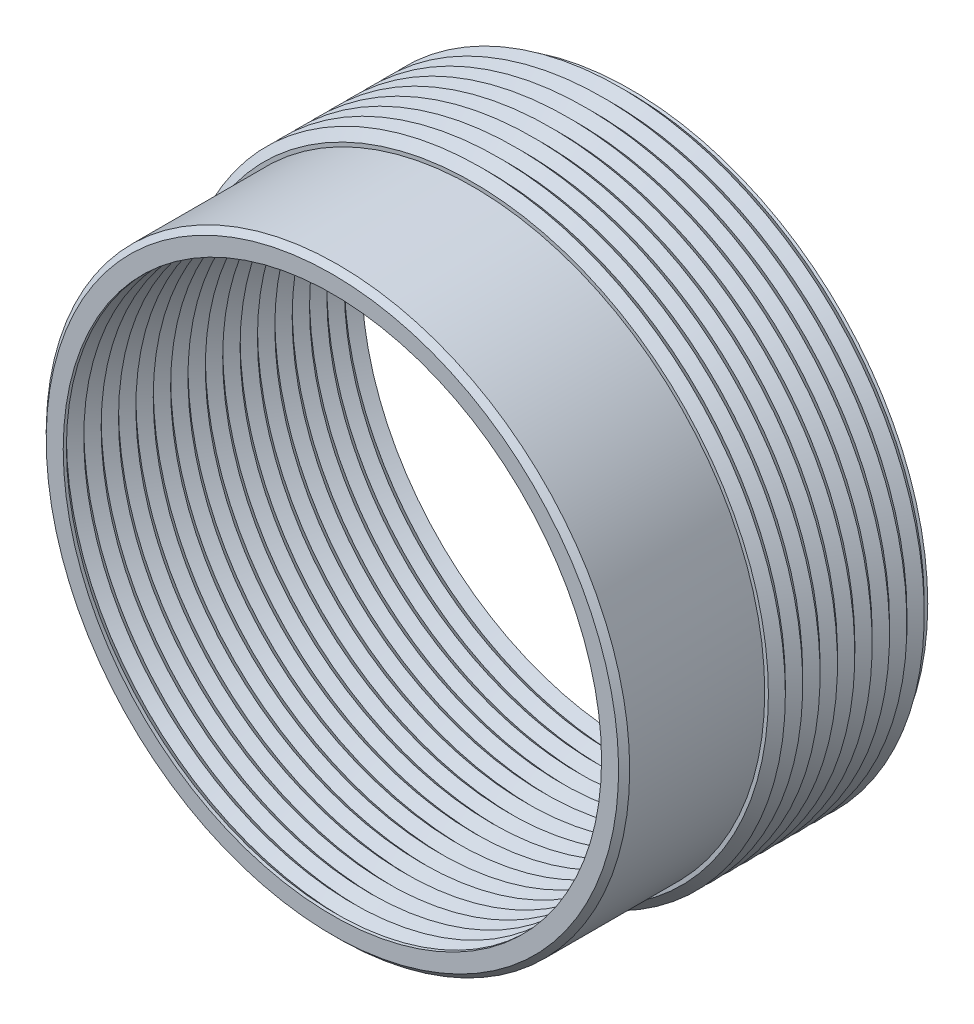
ISO-10303-21;
HEADER;
FILE_DESCRIPTION(('STEP AP214'),'2;1');
FILE_NAME('part.step','',(''),(''),'','','');
FILE_SCHEMA(('AUTOMOTIVE_DESIGN { 1 0 10303 214 1 1 1 1 }'));
ENDSEC;
DATA;
#1=APPLICATION_CONTEXT('core data for automotive mechanical design processes');
#2=APPLICATION_PROTOCOL_DEFINITION('international standard','automotive_design',2000,#1);
#3=PRODUCT_CONTEXT('',#1,'mechanical');
#4=PRODUCT('Part','Part','',(#3));
#5=PRODUCT_RELATED_PRODUCT_CATEGORY('part','',(#4));
#6=PRODUCT_DEFINITION_FORMATION('','',#4);
#7=PRODUCT_DEFINITION_CONTEXT('part definition',#1,'design');
#8=PRODUCT_DEFINITION('design','',#6,#7);
#9=PRODUCT_DEFINITION_SHAPE('','',#8);
#10=(LENGTH_UNIT() NAMED_UNIT(*) SI_UNIT(.MILLI.,.METRE.));
#11=(NAMED_UNIT(*) PLANE_ANGLE_UNIT() SI_UNIT($,.RADIAN.));
#12=(NAMED_UNIT(*) SI_UNIT($,.STERADIAN.) SOLID_ANGLE_UNIT());
#13=UNCERTAINTY_MEASURE_WITH_UNIT(LENGTH_MEASURE(1.E-05),#10,'distance_accuracy_value','');
#14=(GEOMETRIC_REPRESENTATION_CONTEXT(3) GLOBAL_UNCERTAINTY_ASSIGNED_CONTEXT((#13)) GLOBAL_UNIT_ASSIGNED_CONTEXT((#10,
#11,#12)) REPRESENTATION_CONTEXT('',''));
#15=CARTESIAN_POINT('',(0.,0.,0.));
#16=DIRECTION('',(0.,0.,1.));
#17=DIRECTION('',(1.,0.,0.));
#18=AXIS2_PLACEMENT_3D('',#15,#16,#17);
#19=CARTESIAN_POINT('',(0.,0.,2.778125));
#20=DIRECTION('',(0.,0.,-1.));
#21=DIRECTION('',(-1.,0.,0.));
#22=AXIS2_PLACEMENT_3D('',#19,#20,#21);
#23=CONICAL_SURFACE('',#22,12.7,0.785398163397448);
#24=CARTESIAN_POINT('',(0.,0.,2.778125));
#25=DIRECTION('',(0.,0.,1.));
#26=DIRECTION('',(1.,0.,0.));
#27=AXIS2_PLACEMENT_3D('',#24,#25,#26);
#28=CIRCLE('',#27,12.7);
#29=CARTESIAN_POINT('',(12.7,0.,2.778125));
#30=VERTEX_POINT('',#29);
#31=EDGE_CURVE('E182',#30,#30,#28,.F.);
#32=ORIENTED_EDGE('',*,*,#31,.T.);
#33=EDGE_LOOP('',(#32));
#34=FACE_BOUND('',#33,.T.);
#35=CARTESIAN_POINT('',(0.,0.,3.175));
#36=DIRECTION('',(0.,0.,1.));
#37=DIRECTION('',(1.,0.,0.));
#38=AXIS2_PLACEMENT_3D('',#35,#36,#37);
#39=CIRCLE('',#38,12.303125);
#40=CARTESIAN_POINT('',(12.303125,0.,3.175));
#41=VERTEX_POINT('',#40);
#42=EDGE_CURVE('E185',#41,#41,#39,.T.);
#43=ORIENTED_EDGE('',*,*,#42,.T.);
#44=EDGE_LOOP('',(#43));
#45=FACE_BOUND('',#44,.T.);
#46=ADVANCED_FACE('F15',(#34,#45),#23,.F.);
#47=CARTESIAN_POINT('',(0.,0.,3.571875));
#48=DIRECTION('',(0.,0.,1.));
#49=DIRECTION('',(1.,0.,0.));
#50=AXIS2_PLACEMENT_3D('',#47,#48,#49);
#51=CONICAL_SURFACE('',#50,12.7,0.785398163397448);
#52=ORIENTED_EDGE('',*,*,#42,.F.);
#53=EDGE_LOOP('',(#52));
#54=FACE_BOUND('',#53,.T.);
#55=CARTESIAN_POINT('',(0.,0.,3.571875));
#56=DIRECTION('',(0.,0.,-1.));
#57=DIRECTION('',(-1.,0.,0.));
#58=AXIS2_PLACEMENT_3D('',#55,#56,#57);
#59=CIRCLE('',#58,12.7);
#60=CARTESIAN_POINT('',(-12.7,0.,3.571875));
#61=VERTEX_POINT('',#60);
#62=EDGE_CURVE('E179',#61,#61,#59,.F.);
#63=ORIENTED_EDGE('',*,*,#62,.T.);
#64=EDGE_LOOP('',(#63));
#65=FACE_BOUND('',#64,.T.);
#66=ADVANCED_FACE('F774',(#54,#65),#51,.F.);
#67=CARTESIAN_POINT('',(0.,0.,2.778125));
#68=DIRECTION('',(0.,0.,1.));
#69=DIRECTION('',(1.,0.,0.));
#70=AXIS2_PLACEMENT_3D('',#67,#68,#69);
#71=CONICAL_SURFACE('',#70,12.7,0.785398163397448);
#72=ORIENTED_EDGE('',*,*,#31,.F.);
#73=EDGE_LOOP('',(#72));
#74=FACE_BOUND('',#73,.T.);
#75=CARTESIAN_POINT('',(0.,0.,2.38125));
#76=DIRECTION('',(0.,0.,-1.));
#77=DIRECTION('',(-1.,0.,0.));
#78=AXIS2_PLACEMENT_3D('',#75,#76,#77);
#79=CIRCLE('',#78,12.303125);
#80=CARTESIAN_POINT('',(-12.303125,0.,2.38125));
#81=VERTEX_POINT('',#80);
#82=EDGE_CURVE('E176',#81,#81,#79,.T.);
#83=ORIENTED_EDGE('',*,*,#82,.T.);
#84=EDGE_LOOP('',(#83));
#85=FACE_BOUND('',#84,.T.);
#86=ADVANCED_FACE('F765',(#74,#85),#71,.F.);
#87=CARTESIAN_POINT('',(0.,0.,3.571875));
#88=DIRECTION('',(0.,0.,-1.));
#89=DIRECTION('',(-1.,0.,0.));
#90=AXIS2_PLACEMENT_3D('',#87,#88,#89);
#91=CONICAL_SURFACE('',#90,12.7,0.785398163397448);
#92=CARTESIAN_POINT('',(0.,0.,3.96875));
#93=DIRECTION('',(0.,0.,1.));
#94=DIRECTION('',(1.,0.,0.));
#95=AXIS2_PLACEMENT_3D('',#92,#93,#94);
#96=CIRCLE('',#95,12.303125);
#97=CARTESIAN_POINT('',(12.303125,0.,3.96875));
#98=VERTEX_POINT('',#97);
#99=EDGE_CURVE('E173',#98,#98,#96,.T.);
#100=ORIENTED_EDGE('',*,*,#99,.T.);
#101=EDGE_LOOP('',(#100));
#102=FACE_BOUND('',#101,.T.);
#103=ORIENTED_EDGE('',*,*,#62,.F.);
#104=EDGE_LOOP('',(#103));
#105=FACE_BOUND('',#104,.T.);
#106=ADVANCED_FACE('F756',(#102,#105),#91,.F.);
#107=CARTESIAN_POINT('',(0.,0.,1.984375));
#108=DIRECTION('',(0.,0.,-1.));
#109=DIRECTION('',(-1.,0.,0.));
#110=AXIS2_PLACEMENT_3D('',#107,#108,#109);
#111=CONICAL_SURFACE('',#110,12.7,0.785398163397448);
#112=CARTESIAN_POINT('',(0.,0.,1.984375));
#113=DIRECTION('',(0.,0.,1.));
#114=DIRECTION('',(1.,0.,0.));
#115=AXIS2_PLACEMENT_3D('',#112,#113,#114);
#116=CIRCLE('',#115,12.7);
#117=CARTESIAN_POINT('',(12.7,0.,1.984375));
#118=VERTEX_POINT('',#117);
#119=EDGE_CURVE('E170',#118,#118,#116,.F.);
#120=ORIENTED_EDGE('',*,*,#119,.T.);
#121=EDGE_LOOP('',(#120));
#122=FACE_BOUND('',#121,.T.);
#123=ORIENTED_EDGE('',*,*,#82,.F.);
#124=EDGE_LOOP('',(#123));
#125=FACE_BOUND('',#124,.T.);
#126=ADVANCED_FACE('F747',(#122,#125),#111,.F.);
#127=CARTESIAN_POINT('',(0.,0.,4.365625));
#128=DIRECTION('',(0.,0.,1.));
#129=DIRECTION('',(1.,0.,0.));
#130=AXIS2_PLACEMENT_3D('',#127,#128,#129);
#131=CONICAL_SURFACE('',#130,12.7,0.785398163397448);
#132=ORIENTED_EDGE('',*,*,#99,.F.);
#133=EDGE_LOOP('',(#132));
#134=FACE_BOUND('',#133,.T.);
#135=CARTESIAN_POINT('',(0.,0.,4.365625));
#136=DIRECTION('',(0.,0.,-1.));
#137=DIRECTION('',(-1.,0.,0.));
#138=AXIS2_PLACEMENT_3D('',#135,#136,#137);
#139=CIRCLE('',#138,12.7);
#140=CARTESIAN_POINT('',(-12.7,0.,4.365625));
#141=VERTEX_POINT('',#140);
#142=EDGE_CURVE('E167',#141,#141,#139,.F.);
#143=ORIENTED_EDGE('',*,*,#142,.T.);
#144=EDGE_LOOP('',(#143));
#145=FACE_BOUND('',#144,.T.);
#146=ADVANCED_FACE('F738',(#134,#145),#131,.F.);
#147=CARTESIAN_POINT('',(0.,0.,1.984375));
#148=DIRECTION('',(0.,0.,1.));
#149=DIRECTION('',(1.,0.,0.));
#150=AXIS2_PLACEMENT_3D('',#147,#148,#149);
#151=CONICAL_SURFACE('',#150,12.7,0.785398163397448);
#152=ORIENTED_EDGE('',*,*,#119,.F.);
#153=EDGE_LOOP('',(#152));
#154=FACE_BOUND('',#153,.T.);
#155=CARTESIAN_POINT('',(0.,0.,1.5875));
#156=DIRECTION('',(0.,0.,-1.));
#157=DIRECTION('',(-1.,0.,0.));
#158=AXIS2_PLACEMENT_3D('',#155,#156,#157);
#159=CIRCLE('',#158,12.303125);
#160=CARTESIAN_POINT('',(-12.303125,0.,1.5875));
#161=VERTEX_POINT('',#160);
#162=EDGE_CURVE('E164',#161,#161,#159,.T.);
#163=ORIENTED_EDGE('',*,*,#162,.T.);
#164=EDGE_LOOP('',(#163));
#165=FACE_BOUND('',#164,.T.);
#166=ADVANCED_FACE('F729',(#154,#165),#151,.F.);
#167=CARTESIAN_POINT('',(0.,0.,4.365625));
#168=DIRECTION('',(0.,0.,-1.));
#169=DIRECTION('',(-1.,0.,0.));
#170=AXIS2_PLACEMENT_3D('',#167,#168,#169);
#171=CONICAL_SURFACE('',#170,12.7,0.785398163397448);
#172=CARTESIAN_POINT('',(0.,0.,4.7625));
#173=DIRECTION('',(0.,0.,1.));
#174=DIRECTION('',(1.,0.,0.));
#175=AXIS2_PLACEMENT_3D('',#172,#173,#174);
#176=CIRCLE('',#175,12.303125);
#177=CARTESIAN_POINT('',(12.303125,0.,4.7625));
#178=VERTEX_POINT('',#177);
#179=EDGE_CURVE('E161',#178,#178,#176,.T.);
#180=ORIENTED_EDGE('',*,*,#179,.T.);
#181=EDGE_LOOP('',(#180));
#182=FACE_BOUND('',#181,.T.);
#183=ORIENTED_EDGE('',*,*,#142,.F.);
#184=EDGE_LOOP('',(#183));
#185=FACE_BOUND('',#184,.T.);
#186=ADVANCED_FACE('F720',(#182,#185),#171,.F.);
#187=CARTESIAN_POINT('',(0.,0.,1.190625));
#188=DIRECTION('',(0.,0.,-1.));
#189=DIRECTION('',(-1.,0.,0.));
#190=AXIS2_PLACEMENT_3D('',#187,#188,#189);
#191=CONICAL_SURFACE('',#190,12.7,0.785398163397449);
#192=CARTESIAN_POINT('',(0.,0.,1.190625));
#193=DIRECTION('',(0.,0.,1.));
#194=DIRECTION('',(1.,0.,0.));
#195=AXIS2_PLACEMENT_3D('',#192,#193,#194);
#196=CIRCLE('',#195,12.7);
#197=CARTESIAN_POINT('',(12.7,0.,1.190625));
#198=VERTEX_POINT('',#197);
#199=EDGE_CURVE('E158',#198,#198,#196,.F.);
#200=ORIENTED_EDGE('',*,*,#199,.T.);
#201=EDGE_LOOP('',(#200));
#202=FACE_BOUND('',#201,.T.);
#203=ORIENTED_EDGE('',*,*,#162,.F.);
#204=EDGE_LOOP('',(#203));
#205=FACE_BOUND('',#204,.T.);
#206=ADVANCED_FACE('F711',(#202,#205),#191,.F.);
#207=CARTESIAN_POINT('',(0.,0.,5.159375));
#208=DIRECTION('',(0.,0.,1.));
#209=DIRECTION('',(0.,-1.,0.));
#210=AXIS2_PLACEMENT_3D('',#207,#208,#209);
#211=CONICAL_SURFACE('',#210,12.7,0.785398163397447);
#212=ORIENTED_EDGE('',*,*,#179,.F.);
#213=EDGE_LOOP('',(#212));
#214=FACE_BOUND('',#213,.T.);
#215=CARTESIAN_POINT('',(0.,0.,5.159375));
#216=DIRECTION('',(0.,0.,-1.));
#217=DIRECTION('',(-1.,0.,0.));
#218=AXIS2_PLACEMENT_3D('',#215,#216,#217);
#219=CIRCLE('',#218,12.7);
#220=CARTESIAN_POINT('',(-12.7,0.,5.159375));
#221=VERTEX_POINT('',#220);
#222=EDGE_CURVE('E155',#221,#221,#219,.F.);
#223=ORIENTED_EDGE('',*,*,#222,.T.);
#224=EDGE_LOOP('',(#223));
#225=FACE_BOUND('',#224,.T.);
#226=ADVANCED_FACE('F702',(#214,#225),#211,.F.);
#227=CARTESIAN_POINT('',(0.,0.,1.190625));
#228=DIRECTION('',(0.,0.,1.));
#229=DIRECTION('',(1.,0.,0.));
#230=AXIS2_PLACEMENT_3D('',#227,#228,#229);
#231=CONICAL_SURFACE('',#230,12.7,0.785398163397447);
#232=ORIENTED_EDGE('',*,*,#199,.F.);
#233=EDGE_LOOP('',(#232));
#234=FACE_BOUND('',#233,.T.);
#235=CARTESIAN_POINT('',(0.,0.,0.793749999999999));
#236=DIRECTION('',(0.,0.,-1.));
#237=DIRECTION('',(-1.,0.,0.));
#238=AXIS2_PLACEMENT_3D('',#235,#236,#237);
#239=CIRCLE('',#238,12.303125);
#240=CARTESIAN_POINT('',(-12.303125,0.,0.793749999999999));
#241=VERTEX_POINT('',#240);
#242=EDGE_CURVE('E152',#241,#241,#239,.T.);
#243=ORIENTED_EDGE('',*,*,#242,.T.);
#244=EDGE_LOOP('',(#243));
#245=FACE_BOUND('',#244,.T.);
#246=ADVANCED_FACE('F693',(#234,#245),#231,.F.);
#247=CARTESIAN_POINT('',(0.,0.,5.159375));
#248=DIRECTION('',(0.,0.,-1.));
#249=DIRECTION('',(-1.,0.,0.));
#250=AXIS2_PLACEMENT_3D('',#247,#248,#249);
#251=CONICAL_SURFACE('',#250,12.7,0.785398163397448);
#252=CARTESIAN_POINT('',(0.,0.,5.55625));
#253=DIRECTION('',(0.,0.,1.));
#254=DIRECTION('',(1.,0.,0.));
#255=AXIS2_PLACEMENT_3D('',#252,#253,#254);
#256=CIRCLE('',#255,12.303125);
#257=CARTESIAN_POINT('',(12.303125,0.,5.55625));
#258=VERTEX_POINT('',#257);
#259=EDGE_CURVE('E149',#258,#258,#256,.T.);
#260=ORIENTED_EDGE('',*,*,#259,.T.);
#261=EDGE_LOOP('',(#260));
#262=FACE_BOUND('',#261,.T.);
#263=ORIENTED_EDGE('',*,*,#222,.F.);
#264=EDGE_LOOP('',(#263));
#265=FACE_BOUND('',#264,.T.);
#266=ADVANCED_FACE('F684',(#262,#265),#251,.F.);
#267=CARTESIAN_POINT('',(0.,0.,0.396875));
#268=DIRECTION('',(0.,0.,-1.));
#269=DIRECTION('',(0.,1.,0.));
#270=AXIS2_PLACEMENT_3D('',#267,#268,#269);
#271=CONICAL_SURFACE('',#270,12.7,0.785398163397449);
#272=CARTESIAN_POINT('',(0.,0.,0.396875));
#273=DIRECTION('',(0.,0.,1.));
#274=DIRECTION('',(1.,0.,0.));
#275=AXIS2_PLACEMENT_3D('',#272,#273,#274);
#276=CIRCLE('',#275,12.7);
#277=CARTESIAN_POINT('',(12.7,0.,0.396875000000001));
#278=VERTEX_POINT('',#277);
#279=EDGE_CURVE('E146',#278,#278,#276,.F.);
#280=ORIENTED_EDGE('',*,*,#279,.T.);
#281=EDGE_LOOP('',(#280));
#282=FACE_BOUND('',#281,.T.);
#283=ORIENTED_EDGE('',*,*,#242,.F.);
#284=EDGE_LOOP('',(#283));
#285=FACE_BOUND('',#284,.T.);
#286=ADVANCED_FACE('F220',(#282,#285),#271,.F.);
#287=CARTESIAN_POINT('',(0.,0.,5.953125));
#288=DIRECTION('',(0.,0.,1.));
#289=DIRECTION('',(0.,-1.,0.));
#290=AXIS2_PLACEMENT_3D('',#287,#288,#289);
#291=CONICAL_SURFACE('',#290,12.7,0.785398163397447);
#292=ORIENTED_EDGE('',*,*,#259,.F.);
#293=EDGE_LOOP('',(#292));
#294=FACE_BOUND('',#293,.T.);
#295=CARTESIAN_POINT('',(0.,0.,5.953125));
#296=DIRECTION('',(0.,0.,-1.));
#297=DIRECTION('',(-1.,0.,0.));
#298=AXIS2_PLACEMENT_3D('',#295,#296,#297);
#299=CIRCLE('',#298,12.7);
#300=CARTESIAN_POINT('',(-12.7,0.,5.953125));
#301=VERTEX_POINT('',#300);
#302=EDGE_CURVE('E143',#301,#301,#299,.F.);
#303=ORIENTED_EDGE('',*,*,#302,.T.);
#304=EDGE_LOOP('',(#303));
#305=FACE_BOUND('',#304,.T.);
#306=ADVANCED_FACE('F210',(#294,#305),#291,.F.);
#307=CARTESIAN_POINT('',(0.,0.,0.396875));
#308=DIRECTION('',(0.,0.,1.));
#309=DIRECTION('',(1.,0.,0.));
#310=AXIS2_PLACEMENT_3D('',#307,#308,#309);
#311=CONICAL_SURFACE('',#310,12.7,0.785398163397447);
#312=ORIENTED_EDGE('',*,*,#279,.F.);
#313=EDGE_LOOP('',(#312));
#314=FACE_BOUND('',#313,.T.);
#315=CARTESIAN_POINT('',(0.,0.,0.));
#316=DIRECTION('',(0.,0.,1.));
#317=DIRECTION('',(1.,0.,0.));
#318=AXIS2_PLACEMENT_3D('',#315,#316,#317);
#319=CIRCLE('',#318,12.303125);
#320=CARTESIAN_POINT('',(12.303125,0.,0.));
#321=VERTEX_POINT('',#320);
#322=EDGE_CURVE('E18',#321,#321,#319,.F.);
#323=ORIENTED_EDGE('',*,*,#322,.T.);
#324=EDGE_LOOP('',(#323));
#325=FACE_BOUND('',#324,.T.);
#326=ADVANCED_FACE('F208',(#314,#325),#311,.F.);
#327=CARTESIAN_POINT('',(0.,0.,5.953125));
#328=DIRECTION('',(0.,0.,-1.));
#329=DIRECTION('',(-1.,0.,0.));
#330=AXIS2_PLACEMENT_3D('',#327,#328,#329);
#331=CONICAL_SURFACE('',#330,12.7,0.785398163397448);
#332=CARTESIAN_POINT('',(0.,0.,6.35));
#333=DIRECTION('',(0.,0.,1.));
#334=DIRECTION('',(0.,-1.,0.));
#335=AXIS2_PLACEMENT_3D('',#332,#333,#334);
#336=CIRCLE('',#335,12.303125);
#337=CARTESIAN_POINT('',(0.,-12.303125,6.35));
#338=VERTEX_POINT('',#337);
#339=EDGE_CURVE('E140',#338,#338,#336,.T.);
#340=ORIENTED_EDGE('',*,*,#339,.T.);
#341=EDGE_LOOP('',(#340));
#342=FACE_BOUND('',#341,.T.);
#343=ORIENTED_EDGE('',*,*,#302,.F.);
#344=EDGE_LOOP('',(#343));
#345=FACE_BOUND('',#344,.T.);
#346=ADVANCED_FACE('F203',(#342,#345),#331,.F.);
#347=CARTESIAN_POINT('',(0.,0.,0.));
#348=DIRECTION('',(0.,0.,1.));
#349=DIRECTION('',(1.,0.,0.));
#350=AXIS2_PLACEMENT_3D('',#347,#348,#349);
#351=PLANE('',#350);
#352=CARTESIAN_POINT('',(0.,0.,0.));
#353=DIRECTION('',(0.,0.,-1.));
#354=DIRECTION('',(-1.,0.,0.));
#355=AXIS2_PLACEMENT_3D('',#352,#353,#354);
#356=CIRCLE('',#355,13.573125);
#357=CARTESIAN_POINT('',(-13.573125,0.,0.));
#358=VERTEX_POINT('',#357);
#359=EDGE_CURVE('E139',#358,#358,#356,.F.);
#360=ORIENTED_EDGE('',*,*,#359,.F.);
#361=EDGE_LOOP('',(#360));
#362=FACE_BOUND('',#361,.T.);
#363=ORIENTED_EDGE('',*,*,#322,.F.);
#364=EDGE_LOOP('',(#363));
#365=FACE_BOUND('',#364,.T.);
#366=ADVANCED_FACE('F199',(#362,#365),#351,.F.);
#367=CARTESIAN_POINT('',(0.,0.,6.746875));
#368=DIRECTION('',(0.,0.,1.));
#369=DIRECTION('',(0.,-1.,0.));
#370=AXIS2_PLACEMENT_3D('',#367,#368,#369);
#371=CONICAL_SURFACE('',#370,12.7,0.785398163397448);
#372=CARTESIAN_POINT('',(0.,0.,6.746875));
#373=DIRECTION('',(0.,0.,-1.));
#374=DIRECTION('',(0.,1.,0.));
#375=AXIS2_PLACEMENT_3D('',#372,#373,#374);
#376=CIRCLE('',#375,12.7);
#377=CARTESIAN_POINT('',(0.,12.7,6.746875));
#378=VERTEX_POINT('',#377);
#379=EDGE_CURVE('E136',#378,#378,#376,.F.);
#380=ORIENTED_EDGE('',*,*,#379,.T.);
#381=EDGE_LOOP('',(#380));
#382=FACE_BOUND('',#381,.T.);
#383=ORIENTED_EDGE('',*,*,#339,.F.);
#384=EDGE_LOOP('',(#383));
#385=FACE_BOUND('',#384,.T.);
#386=ADVANCED_FACE('F202',(#382,#385),#371,.F.);
#387=CARTESIAN_POINT('',(0.,0.,0.));
#388=DIRECTION('',(0.,0.,-1.));
#389=DIRECTION('',(-1.,0.,0.));
#390=AXIS2_PLACEMENT_3D('',#387,#388,#389);
#391=CONICAL_SURFACE('',#390,13.573125,0.785398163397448);
#392=CARTESIAN_POINT('',(0.,0.,0.0793750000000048));
#393=DIRECTION('',(0.,0.,1.));
#394=DIRECTION('',(0.,-1.,0.));
#395=AXIS2_PLACEMENT_3D('',#392,#393,#394);
#396=CIRCLE('',#395,13.49375);
#397=CARTESIAN_POINT('',(0.,-13.49375,0.079375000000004));
#398=VERTEX_POINT('',#397);
#399=EDGE_CURVE('E133',#398,#398,#396,.T.);
#400=ORIENTED_EDGE('',*,*,#399,.F.);
#401=EDGE_LOOP('',(#400));
#402=FACE_BOUND('',#401,.T.);
#403=ORIENTED_EDGE('',*,*,#359,.T.);
#404=EDGE_LOOP('',(#403));
#405=FACE_BOUND('',#404,.T.);
#406=ADVANCED_FACE('F197',(#402,#405),#391,.T.);
#407=CARTESIAN_POINT('',(0.,0.,6.746875));
#408=DIRECTION('',(0.,0.,-1.));
#409=DIRECTION('',(-1.,0.,0.));
#410=AXIS2_PLACEMENT_3D('',#407,#408,#409);
#411=CONICAL_SURFACE('',#410,12.7,0.785398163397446);
#412=ORIENTED_EDGE('',*,*,#379,.F.);
#413=EDGE_LOOP('',(#412));
#414=FACE_BOUND('',#413,.T.);
#415=CARTESIAN_POINT('',(0.,0.,7.14375));
#416=DIRECTION('',(0.,0.,1.));
#417=DIRECTION('',(0.,-1.,0.));
#418=AXIS2_PLACEMENT_3D('',#415,#416,#417);
#419=CIRCLE('',#418,12.303125);
#420=CARTESIAN_POINT('',(0.,-12.303125,7.14375));
#421=VERTEX_POINT('',#420);
#422=EDGE_CURVE('E130',#421,#421,#419,.T.);
#423=ORIENTED_EDGE('',*,*,#422,.T.);
#424=EDGE_LOOP('',(#423));
#425=FACE_BOUND('',#424,.T.);
#426=ADVANCED_FACE('F382',(#414,#425),#411,.F.);
#427=CARTESIAN_POINT('',(0.,0.,0.476250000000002));
#428=DIRECTION('',(0.,0.,1.));
#429=DIRECTION('',(1.,0.,0.));
#430=AXIS2_PLACEMENT_3D('',#427,#428,#429);
#431=CONICAL_SURFACE('',#430,13.890625,0.785398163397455);
#432=CARTESIAN_POINT('',(0.,0.,0.476250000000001));
#433=DIRECTION('',(0.,0.,-1.));
#434=DIRECTION('',(-1.,0.,0.));
#435=AXIS2_PLACEMENT_3D('',#432,#433,#434);
#436=CIRCLE('',#435,13.890625);
#437=CARTESIAN_POINT('',(-13.890625,0.,0.476250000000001));
#438=VERTEX_POINT('',#437);
#439=EDGE_CURVE('E127',#438,#438,#436,.F.);
#440=ORIENTED_EDGE('',*,*,#439,.F.);
#441=EDGE_LOOP('',(#440));
#442=FACE_BOUND('',#441,.T.);
#443=ORIENTED_EDGE('',*,*,#399,.T.);
#444=EDGE_LOOP('',(#443));
#445=FACE_BOUND('',#444,.T.);
#446=ADVANCED_FACE('F378',(#442,#445),#431,.T.);
#447=CARTESIAN_POINT('',(0.,0.,7.540625));
#448=DIRECTION('',(0.,0.,1.));
#449=DIRECTION('',(1.,0.,0.));
#450=AXIS2_PLACEMENT_3D('',#447,#448,#449);
#451=CONICAL_SURFACE('',#450,12.7,0.785398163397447);
#452=CARTESIAN_POINT('',(0.,0.,7.540625));
#453=DIRECTION('',(0.,0.,-1.));
#454=DIRECTION('',(0.,1.,0.));
#455=AXIS2_PLACEMENT_3D('',#452,#453,#454);
#456=CIRCLE('',#455,12.7);
#457=CARTESIAN_POINT('',(0.,12.7,7.540625));
#458=VERTEX_POINT('',#457);
#459=EDGE_CURVE('E124',#458,#458,#456,.F.);
#460=ORIENTED_EDGE('',*,*,#459,.T.);
#461=EDGE_LOOP('',(#460));
#462=FACE_BOUND('',#461,.T.);
#463=ORIENTED_EDGE('',*,*,#422,.F.);
#464=EDGE_LOOP('',(#463));
#465=FACE_BOUND('',#464,.T.);
#466=ADVANCED_FACE('F374',(#462,#465),#451,.F.);
#467=CARTESIAN_POINT('',(0.,0.,0.476249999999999));
#468=DIRECTION('',(0.,0.,-1.));
#469=DIRECTION('',(-1.,0.,0.));
#470=AXIS2_PLACEMENT_3D('',#467,#468,#469);
#471=CONICAL_SURFACE('',#470,13.890625,0.785398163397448);
#472=CARTESIAN_POINT('',(0.,0.,0.873125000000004));
#473=DIRECTION('',(0.,0.,1.));
#474=DIRECTION('',(1.,0.,0.));
#475=AXIS2_PLACEMENT_3D('',#472,#473,#474);
#476=CIRCLE('',#475,13.49375);
#477=CARTESIAN_POINT('',(13.49375,0.,0.873125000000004));
#478=VERTEX_POINT('',#477);
#479=EDGE_CURVE('E121',#478,#478,#476,.T.);
#480=ORIENTED_EDGE('',*,*,#479,.F.);
#481=EDGE_LOOP('',(#480));
#482=FACE_BOUND('',#481,.T.);
#483=ORIENTED_EDGE('',*,*,#439,.T.);
#484=EDGE_LOOP('',(#483));
#485=FACE_BOUND('',#484,.T.);
#486=ADVANCED_FACE('F370',(#482,#485),#471,.T.);
#487=CARTESIAN_POINT('',(0.,0.,7.540625));
#488=DIRECTION('',(0.,0.,-1.));
#489=DIRECTION('',(-1.,0.,0.));
#490=AXIS2_PLACEMENT_3D('',#487,#488,#489);
#491=CONICAL_SURFACE('',#490,12.7,0.785398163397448);
#492=ORIENTED_EDGE('',*,*,#459,.F.);
#493=EDGE_LOOP('',(#492));
#494=FACE_BOUND('',#493,.T.);
#495=CARTESIAN_POINT('',(0.,0.,7.9375));
#496=DIRECTION('',(0.,0.,1.));
#497=DIRECTION('',(1.,0.,0.));
#498=AXIS2_PLACEMENT_3D('',#495,#496,#497);
#499=CIRCLE('',#498,12.303125);
#500=CARTESIAN_POINT('',(12.303125,0.,7.9375));
#501=VERTEX_POINT('',#500);
#502=EDGE_CURVE('E118',#501,#501,#499,.T.);
#503=ORIENTED_EDGE('',*,*,#502,.T.);
#504=EDGE_LOOP('',(#503));
#505=FACE_BOUND('',#504,.T.);
#506=ADVANCED_FACE('F366',(#494,#505),#491,.F.);
#507=CARTESIAN_POINT('',(0.,0.,1.27));
#508=DIRECTION('',(0.,0.,1.));
#509=DIRECTION('',(1.,0.,0.));
#510=AXIS2_PLACEMENT_3D('',#507,#508,#509);
#511=CONICAL_SURFACE('',#510,13.890625,0.785398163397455);
#512=ORIENTED_EDGE('',*,*,#479,.T.);
#513=EDGE_LOOP('',(#512));
#514=FACE_BOUND('',#513,.T.);
#515=CARTESIAN_POINT('',(0.,0.,1.27));
#516=DIRECTION('',(0.,0.,-1.));
#517=DIRECTION('',(-1.,0.,0.));
#518=AXIS2_PLACEMENT_3D('',#515,#516,#517);
#519=CIRCLE('',#518,13.890625);
#520=CARTESIAN_POINT('',(-13.890625,0.,1.27));
#521=VERTEX_POINT('',#520);
#522=EDGE_CURVE('E115',#521,#521,#519,.F.);
#523=ORIENTED_EDGE('',*,*,#522,.F.);
#524=EDGE_LOOP('',(#523));
#525=FACE_BOUND('',#524,.T.);
#526=ADVANCED_FACE('F362',(#514,#525),#511,.T.);
#527=CARTESIAN_POINT('',(0.,0.,8.334375));
#528=DIRECTION('',(0.,0.,1.));
#529=DIRECTION('',(1.,0.,0.));
#530=AXIS2_PLACEMENT_3D('',#527,#528,#529);
#531=CONICAL_SURFACE('',#530,12.7,0.785398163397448);
#532=ORIENTED_EDGE('',*,*,#502,.F.);
#533=EDGE_LOOP('',(#532));
#534=FACE_BOUND('',#533,.T.);
#535=CARTESIAN_POINT('',(0.,0.,8.334375));
#536=DIRECTION('',(0.,0.,-1.));
#537=DIRECTION('',(-1.,0.,0.));
#538=AXIS2_PLACEMENT_3D('',#535,#536,#537);
#539=CIRCLE('',#538,12.7);
#540=CARTESIAN_POINT('',(-12.7,0.,8.334375));
#541=VERTEX_POINT('',#540);
#542=EDGE_CURVE('E112',#541,#541,#539,.F.);
#543=ORIENTED_EDGE('',*,*,#542,.T.);
#544=EDGE_LOOP('',(#543));
#545=FACE_BOUND('',#544,.T.);
#546=ADVANCED_FACE('F358',(#534,#545),#531,.F.);
#547=CARTESIAN_POINT('',(0.,0.,1.27));
#548=DIRECTION('',(0.,0.,-1.));
#549=DIRECTION('',(-1.,0.,0.));
#550=AXIS2_PLACEMENT_3D('',#547,#548,#549);
#551=CONICAL_SURFACE('',#550,13.890625,0.785398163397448);
#552=CARTESIAN_POINT('',(0.,0.,1.66687500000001));
#553=DIRECTION('',(0.,0.,1.));
#554=DIRECTION('',(1.,0.,0.));
#555=AXIS2_PLACEMENT_3D('',#552,#553,#554);
#556=CIRCLE('',#555,13.49375);
#557=CARTESIAN_POINT('',(13.49375,0.,1.666875));
#558=VERTEX_POINT('',#557);
#559=EDGE_CURVE('E109',#558,#558,#556,.T.);
#560=ORIENTED_EDGE('',*,*,#559,.F.);
#561=EDGE_LOOP('',(#560));
#562=FACE_BOUND('',#561,.T.);
#563=ORIENTED_EDGE('',*,*,#522,.T.);
#564=EDGE_LOOP('',(#563));
#565=FACE_BOUND('',#564,.T.);
#566=ADVANCED_FACE('F354',(#562,#565),#551,.T.);
#567=CARTESIAN_POINT('',(0.,0.,8.334375));
#568=DIRECTION('',(0.,0.,-1.));
#569=DIRECTION('',(-1.,0.,0.));
#570=AXIS2_PLACEMENT_3D('',#567,#568,#569);
#571=CONICAL_SURFACE('',#570,12.7,0.785398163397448);
#572=CARTESIAN_POINT('',(0.,0.,8.73125));
#573=DIRECTION('',(0.,0.,1.));
#574=DIRECTION('',(1.,0.,0.));
#575=AXIS2_PLACEMENT_3D('',#572,#573,#574);
#576=CIRCLE('',#575,12.303125);
#577=CARTESIAN_POINT('',(12.303125,0.,8.73125));
#578=VERTEX_POINT('',#577);
#579=EDGE_CURVE('E106',#578,#578,#576,.T.);
#580=ORIENTED_EDGE('',*,*,#579,.T.);
#581=EDGE_LOOP('',(#580));
#582=FACE_BOUND('',#581,.T.);
#583=ORIENTED_EDGE('',*,*,#542,.F.);
#584=EDGE_LOOP('',(#583));
#585=FACE_BOUND('',#584,.T.);
#586=ADVANCED_FACE('F350',(#582,#585),#571,.F.);
#587=CARTESIAN_POINT('',(0.,0.,2.06375));
#588=DIRECTION('',(0.,0.,1.));
#589=DIRECTION('',(0.,-1.,0.));
#590=AXIS2_PLACEMENT_3D('',#587,#588,#589);
#591=CONICAL_SURFACE('',#590,13.890625,0.785398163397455);
#592=ORIENTED_EDGE('',*,*,#559,.T.);
#593=EDGE_LOOP('',(#592));
#594=FACE_BOUND('',#593,.T.);
#595=CARTESIAN_POINT('',(0.,0.,2.06375));
#596=DIRECTION('',(0.,0.,-1.));
#597=DIRECTION('',(-1.,0.,0.));
#598=AXIS2_PLACEMENT_3D('',#595,#596,#597);
#599=CIRCLE('',#598,13.890625);
#600=CARTESIAN_POINT('',(-13.890625,0.,2.06375));
#601=VERTEX_POINT('',#600);
#602=EDGE_CURVE('E103',#601,#601,#599,.F.);
#603=ORIENTED_EDGE('',*,*,#602,.F.);
#604=EDGE_LOOP('',(#603));
#605=FACE_BOUND('',#604,.T.);
#606=ADVANCED_FACE('F346',(#594,#605),#591,.T.);
#607=CARTESIAN_POINT('',(0.,0.,9.128125));
#608=DIRECTION('',(0.,0.,1.));
#609=DIRECTION('',(1.,0.,0.));
#610=AXIS2_PLACEMENT_3D('',#607,#608,#609);
#611=CONICAL_SURFACE('',#610,12.7,0.785398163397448);
#612=ORIENTED_EDGE('',*,*,#579,.F.);
#613=EDGE_LOOP('',(#612));
#614=FACE_BOUND('',#613,.T.);
#615=CARTESIAN_POINT('',(0.,0.,9.128125));
#616=DIRECTION('',(0.,0.,-1.));
#617=DIRECTION('',(-1.,0.,0.));
#618=AXIS2_PLACEMENT_3D('',#615,#616,#617);
#619=CIRCLE('',#618,12.7);
#620=CARTESIAN_POINT('',(-12.7,0.,9.128125));
#621=VERTEX_POINT('',#620);
#622=EDGE_CURVE('E100',#621,#621,#619,.F.);
#623=ORIENTED_EDGE('',*,*,#622,.T.);
#624=EDGE_LOOP('',(#623));
#625=FACE_BOUND('',#624,.T.);
#626=ADVANCED_FACE('F342',(#614,#625),#611,.F.);
#627=CARTESIAN_POINT('',(0.,0.,2.06375));
#628=DIRECTION('',(0.,0.,-1.));
#629=DIRECTION('',(-1.,0.,0.));
#630=AXIS2_PLACEMENT_3D('',#627,#628,#629);
#631=CONICAL_SURFACE('',#630,13.890625,0.785398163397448);
#632=CARTESIAN_POINT('',(0.,0.,2.460625));
#633=DIRECTION('',(0.,0.,1.));
#634=DIRECTION('',(1.,0.,0.));
#635=AXIS2_PLACEMENT_3D('',#632,#633,#634);
#636=CIRCLE('',#635,13.49375);
#637=CARTESIAN_POINT('',(13.49375,0.,2.460625));
#638=VERTEX_POINT('',#637);
#639=EDGE_CURVE('E97',#638,#638,#636,.T.);
#640=ORIENTED_EDGE('',*,*,#639,.F.);
#641=EDGE_LOOP('',(#640));
#642=FACE_BOUND('',#641,.T.);
#643=ORIENTED_EDGE('',*,*,#602,.T.);
#644=EDGE_LOOP('',(#643));
#645=FACE_BOUND('',#644,.T.);
#646=ADVANCED_FACE('F338',(#642,#645),#631,.T.);
#647=CARTESIAN_POINT('',(0.,0.,9.128125));
#648=DIRECTION('',(0.,0.,-1.));
#649=DIRECTION('',(-1.,0.,0.));
#650=AXIS2_PLACEMENT_3D('',#647,#648,#649);
#651=CONICAL_SURFACE('',#650,12.7,0.785398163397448);
#652=CARTESIAN_POINT('',(0.,0.,9.525));
#653=DIRECTION('',(0.,0.,1.));
#654=DIRECTION('',(0.,-1.,0.));
#655=AXIS2_PLACEMENT_3D('',#652,#653,#654);
#656=CIRCLE('',#655,12.303125);
#657=CARTESIAN_POINT('',(0.,-12.303125,9.525));
#658=VERTEX_POINT('',#657);
#659=EDGE_CURVE('E94',#658,#658,#656,.T.);
#660=ORIENTED_EDGE('',*,*,#659,.T.);
#661=EDGE_LOOP('',(#660));
#662=FACE_BOUND('',#661,.T.);
#663=ORIENTED_EDGE('',*,*,#622,.F.);
#664=EDGE_LOOP('',(#663));
#665=FACE_BOUND('',#664,.T.);
#666=ADVANCED_FACE('F334',(#662,#665),#651,.F.);
#667=CARTESIAN_POINT('',(0.,0.,2.8575));
#668=DIRECTION('',(0.,0.,1.));
#669=DIRECTION('',(1.,0.,0.));
#670=AXIS2_PLACEMENT_3D('',#667,#668,#669);
#671=CONICAL_SURFACE('',#670,13.890625,0.785398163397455);
#672=ORIENTED_EDGE('',*,*,#639,.T.);
#673=EDGE_LOOP('',(#672));
#674=FACE_BOUND('',#673,.T.);
#675=CARTESIAN_POINT('',(0.,0.,2.8575));
#676=DIRECTION('',(0.,0.,-1.));
#677=DIRECTION('',(-1.,0.,0.));
#678=AXIS2_PLACEMENT_3D('',#675,#676,#677);
#679=CIRCLE('',#678,13.890625);
#680=CARTESIAN_POINT('',(-13.890625,0.,2.8575));
#681=VERTEX_POINT('',#680);
#682=EDGE_CURVE('E91',#681,#681,#679,.F.);
#683=ORIENTED_EDGE('',*,*,#682,.F.);
#684=EDGE_LOOP('',(#683));
#685=FACE_BOUND('',#684,.T.);
#686=ADVANCED_FACE('F330',(#674,#685),#671,.T.);
#687=CARTESIAN_POINT('',(0.,0.,9.921875));
#688=DIRECTION('',(0.,0.,1.));
#689=DIRECTION('',(0.,-1.,0.));
#690=AXIS2_PLACEMENT_3D('',#687,#688,#689);
#691=CONICAL_SURFACE('',#690,12.7,0.785398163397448);
#692=CARTESIAN_POINT('',(0.,0.,9.921875));
#693=DIRECTION('',(0.,0.,-1.));
#694=DIRECTION('',(0.,1.,0.));
#695=AXIS2_PLACEMENT_3D('',#692,#693,#694);
#696=CIRCLE('',#695,12.7);
#697=CARTESIAN_POINT('',(0.,12.7,9.921875));
#698=VERTEX_POINT('',#697);
#699=EDGE_CURVE('E88',#698,#698,#696,.F.);
#700=ORIENTED_EDGE('',*,*,#699,.T.);
#701=EDGE_LOOP('',(#700));
#702=FACE_BOUND('',#701,.T.);
#703=ORIENTED_EDGE('',*,*,#659,.F.);
#704=EDGE_LOOP('',(#703));
#705=FACE_BOUND('',#704,.T.);
#706=ADVANCED_FACE('F326',(#702,#705),#691,.F.);
#707=CARTESIAN_POINT('',(0.,0.,2.8575));
#708=DIRECTION('',(0.,0.,-1.));
#709=DIRECTION('',(-1.,0.,0.));
#710=AXIS2_PLACEMENT_3D('',#707,#708,#709);
#711=CONICAL_SURFACE('',#710,13.890625,0.785398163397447);
#712=CARTESIAN_POINT('',(0.,0.,3.254375));
#713=DIRECTION('',(0.,0.,1.));
#714=DIRECTION('',(1.,0.,0.));
#715=AXIS2_PLACEMENT_3D('',#712,#713,#714);
#716=CIRCLE('',#715,13.49375);
#717=CARTESIAN_POINT('',(13.49375,0.,3.254375));
#718=VERTEX_POINT('',#717);
#719=EDGE_CURVE('E85',#718,#718,#716,.T.);
#720=ORIENTED_EDGE('',*,*,#719,.F.);
#721=EDGE_LOOP('',(#720));
#722=FACE_BOUND('',#721,.T.);
#723=ORIENTED_EDGE('',*,*,#682,.T.);
#724=EDGE_LOOP('',(#723));
#725=FACE_BOUND('',#724,.T.);
#726=ADVANCED_FACE('F322',(#722,#725),#711,.T.);
#727=CARTESIAN_POINT('',(0.,0.,9.921875));
#728=DIRECTION('',(0.,0.,-1.));
#729=DIRECTION('',(0.,1.,0.));
#730=AXIS2_PLACEMENT_3D('',#727,#728,#729);
#731=CONICAL_SURFACE('',#730,12.7,0.785398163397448);
#732=ORIENTED_EDGE('',*,*,#699,.F.);
#733=EDGE_LOOP('',(#732));
#734=FACE_BOUND('',#733,.T.);
#735=CARTESIAN_POINT('',(0.,0.,10.31875));
#736=DIRECTION('',(0.,0.,1.));
#737=DIRECTION('',(1.,0.,0.));
#738=AXIS2_PLACEMENT_3D('',#735,#736,#737);
#739=CIRCLE('',#738,12.303125);
#740=CARTESIAN_POINT('',(12.303125,0.,10.31875));
#741=VERTEX_POINT('',#740);
#742=EDGE_CURVE('E82',#741,#741,#739,.T.);
#743=ORIENTED_EDGE('',*,*,#742,.T.);
#744=EDGE_LOOP('',(#743));
#745=FACE_BOUND('',#744,.T.);
#746=ADVANCED_FACE('F318',(#734,#745),#731,.F.);
#747=CARTESIAN_POINT('',(0.,0.,3.65125));
#748=DIRECTION('',(0.,0.,1.));
#749=DIRECTION('',(0.,-1.,0.));
#750=AXIS2_PLACEMENT_3D('',#747,#748,#749);
#751=CONICAL_SURFACE('',#750,13.890625,0.785398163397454);
#752=ORIENTED_EDGE('',*,*,#719,.T.);
#753=EDGE_LOOP('',(#752));
#754=FACE_BOUND('',#753,.T.);
#755=CARTESIAN_POINT('',(0.,0.,3.65125));
#756=DIRECTION('',(0.,0.,-1.));
#757=DIRECTION('',(-1.,0.,0.));
#758=AXIS2_PLACEMENT_3D('',#755,#756,#757);
#759=CIRCLE('',#758,13.890625);
#760=CARTESIAN_POINT('',(-13.890625,0.,3.65125));
#761=VERTEX_POINT('',#760);
#762=EDGE_CURVE('E79',#761,#761,#759,.F.);
#763=ORIENTED_EDGE('',*,*,#762,.F.);
#764=EDGE_LOOP('',(#763));
#765=FACE_BOUND('',#764,.T.);
#766=ADVANCED_FACE('F314',(#754,#765),#751,.T.);
#767=CARTESIAN_POINT('',(0.,0.,10.715625));
#768=DIRECTION('',(0.,0.,1.));
#769=DIRECTION('',(1.,0.,0.));
#770=AXIS2_PLACEMENT_3D('',#767,#768,#769);
#771=CONICAL_SURFACE('',#770,12.7,0.785398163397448);
#772=ORIENTED_EDGE('',*,*,#742,.F.);
#773=EDGE_LOOP('',(#772));
#774=FACE_BOUND('',#773,.T.);
#775=CARTESIAN_POINT('',(0.,0.,10.715625));
#776=DIRECTION('',(0.,0.,-1.));
#777=DIRECTION('',(-1.,0.,0.));
#778=AXIS2_PLACEMENT_3D('',#775,#776,#777);
#779=CIRCLE('',#778,12.7);
#780=CARTESIAN_POINT('',(-12.7,0.,10.715625));
#781=VERTEX_POINT('',#780);
#782=EDGE_CURVE('E76',#781,#781,#779,.F.);
#783=ORIENTED_EDGE('',*,*,#782,.T.);
#784=EDGE_LOOP('',(#783));
#785=FACE_BOUND('',#784,.T.);
#786=ADVANCED_FACE('F310',(#774,#785),#771,.F.);
#787=CARTESIAN_POINT('',(0.,0.,3.65125));
#788=DIRECTION('',(0.,0.,-1.));
#789=DIRECTION('',(0.,1.,0.));
#790=AXIS2_PLACEMENT_3D('',#787,#788,#789);
#791=CONICAL_SURFACE('',#790,13.890625,0.785398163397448);
#792=CARTESIAN_POINT('',(0.,0.,4.048125));
#793=DIRECTION('',(0.,0.,1.));
#794=DIRECTION('',(0.,-1.,0.));
#795=AXIS2_PLACEMENT_3D('',#792,#793,#794);
#796=CIRCLE('',#795,13.49375);
#797=CARTESIAN_POINT('',(0.,-13.49375,4.048125));
#798=VERTEX_POINT('',#797);
#799=EDGE_CURVE('E73',#798,#798,#796,.T.);
#800=ORIENTED_EDGE('',*,*,#799,.F.);
#801=EDGE_LOOP('',(#800));
#802=FACE_BOUND('',#801,.T.);
#803=ORIENTED_EDGE('',*,*,#762,.T.);
#804=EDGE_LOOP('',(#803));
#805=FACE_BOUND('',#804,.T.);
#806=ADVANCED_FACE('F306',(#802,#805),#791,.T.);
#807=CARTESIAN_POINT('',(0.,0.,10.715625));
#808=DIRECTION('',(0.,0.,-1.));
#809=DIRECTION('',(-1.,0.,0.));
#810=AXIS2_PLACEMENT_3D('',#807,#808,#809);
#811=CONICAL_SURFACE('',#810,12.7,0.785398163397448);
#812=CARTESIAN_POINT('',(0.,0.,11.1125));
#813=DIRECTION('',(0.,0.,1.));
#814=DIRECTION('',(1.,0.,0.));
#815=AXIS2_PLACEMENT_3D('',#812,#813,#814);
#816=CIRCLE('',#815,12.303125);
#817=CARTESIAN_POINT('',(12.303125,0.,11.1125));
#818=VERTEX_POINT('',#817);
#819=EDGE_CURVE('E70',#818,#818,#816,.T.);
#820=ORIENTED_EDGE('',*,*,#819,.T.);
#821=EDGE_LOOP('',(#820));
#822=FACE_BOUND('',#821,.T.);
#823=ORIENTED_EDGE('',*,*,#782,.F.);
#824=EDGE_LOOP('',(#823));
#825=FACE_BOUND('',#824,.T.);
#826=ADVANCED_FACE('F302',(#822,#825),#811,.F.);
#827=CARTESIAN_POINT('',(0.,0.,4.445));
#828=DIRECTION('',(0.,0.,1.));
#829=DIRECTION('',(1.,0.,0.));
#830=AXIS2_PLACEMENT_3D('',#827,#828,#829);
#831=CONICAL_SURFACE('',#830,13.890625,0.785398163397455);
#832=ORIENTED_EDGE('',*,*,#799,.T.);
#833=EDGE_LOOP('',(#832));
#834=FACE_BOUND('',#833,.T.);
#835=CARTESIAN_POINT('',(0.,0.,4.445));
#836=DIRECTION('',(0.,0.,-1.));
#837=DIRECTION('',(-1.,0.,0.));
#838=AXIS2_PLACEMENT_3D('',#835,#836,#837);
#839=CIRCLE('',#838,13.890625);
#840=CARTESIAN_POINT('',(-13.890625,0.,4.445));
#841=VERTEX_POINT('',#840);
#842=EDGE_CURVE('E67',#841,#841,#839,.F.);
#843=ORIENTED_EDGE('',*,*,#842,.F.);
#844=EDGE_LOOP('',(#843));
#845=FACE_BOUND('',#844,.T.);
#846=ADVANCED_FACE('F298',(#834,#845),#831,.T.);
#847=CARTESIAN_POINT('',(0.,0.,11.509375));
#848=DIRECTION('',(0.,0.,1.));
#849=DIRECTION('',(1.,0.,0.));
#850=AXIS2_PLACEMENT_3D('',#847,#848,#849);
#851=CONICAL_SURFACE('',#850,12.7,0.785398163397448);
#852=ORIENTED_EDGE('',*,*,#819,.F.);
#853=EDGE_LOOP('',(#852));
#854=FACE_BOUND('',#853,.T.);
#855=CARTESIAN_POINT('',(0.,0.,11.509375));
#856=DIRECTION('',(0.,0.,-1.));
#857=DIRECTION('',(-1.,0.,0.));
#858=AXIS2_PLACEMENT_3D('',#855,#856,#857);
#859=CIRCLE('',#858,12.7);
#860=CARTESIAN_POINT('',(-12.7,0.,11.509375));
#861=VERTEX_POINT('',#860);
#862=EDGE_CURVE('E64',#861,#861,#859,.F.);
#863=ORIENTED_EDGE('',*,*,#862,.T.);
#864=EDGE_LOOP('',(#863));
#865=FACE_BOUND('',#864,.T.);
#866=ADVANCED_FACE('F294',(#854,#865),#851,.F.);
#867=CARTESIAN_POINT('',(0.,0.,4.445));
#868=DIRECTION('',(0.,0.,-1.));
#869=DIRECTION('',(-1.,0.,0.));
#870=AXIS2_PLACEMENT_3D('',#867,#868,#869);
#871=CONICAL_SURFACE('',#870,13.890625,0.785398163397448);
#872=ORIENTED_EDGE('',*,*,#842,.T.);
#873=EDGE_LOOP('',(#872));
#874=FACE_BOUND('',#873,.T.);
#875=CARTESIAN_POINT('',(0.,0.,4.841875));
#876=DIRECTION('',(0.,0.,1.));
#877=DIRECTION('',(1.,0.,0.));
#878=AXIS2_PLACEMENT_3D('',#875,#876,#877);
#879=CIRCLE('',#878,13.49375);
#880=CARTESIAN_POINT('',(13.49375,0.,4.841875));
#881=VERTEX_POINT('',#880);
#882=EDGE_CURVE('E61',#881,#881,#879,.T.);
#883=ORIENTED_EDGE('',*,*,#882,.F.);
#884=EDGE_LOOP('',(#883));
#885=FACE_BOUND('',#884,.T.);
#886=ADVANCED_FACE('F290',(#874,#885),#871,.T.);
#887=CARTESIAN_POINT('',(0.,0.,11.509375));
#888=DIRECTION('',(0.,0.,-1.));
#889=DIRECTION('',(-1.,0.,0.));
#890=AXIS2_PLACEMENT_3D('',#887,#888,#889);
#891=CONICAL_SURFACE('',#890,12.7,0.785398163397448);
#892=CARTESIAN_POINT('',(0.,0.,11.90625));
#893=DIRECTION('',(0.,0.,1.));
#894=DIRECTION('',(0.,-1.,0.));
#895=AXIS2_PLACEMENT_3D('',#892,#893,#894);
#896=CIRCLE('',#895,12.303125);
#897=CARTESIAN_POINT('',(0.,-12.303125,11.90625));
#898=VERTEX_POINT('',#897);
#899=EDGE_CURVE('E58',#898,#898,#896,.T.);
#900=ORIENTED_EDGE('',*,*,#899,.T.);
#901=EDGE_LOOP('',(#900));
#902=FACE_BOUND('',#901,.T.);
#903=ORIENTED_EDGE('',*,*,#862,.F.);
#904=EDGE_LOOP('',(#903));
#905=FACE_BOUND('',#904,.T.);
#906=ADVANCED_FACE('F286',(#902,#905),#891,.F.);
#907=CARTESIAN_POINT('',(0.,0.,5.23875));
#908=DIRECTION('',(0.,0.,1.));
#909=DIRECTION('',(1.,0.,0.));
#910=AXIS2_PLACEMENT_3D('',#907,#908,#909);
#911=CONICAL_SURFACE('',#910,13.890625,0.785398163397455);
#912=CARTESIAN_POINT('',(0.,0.,5.23875));
#913=DIRECTION('',(0.,0.,-1.));
#914=DIRECTION('',(-1.,0.,0.));
#915=AXIS2_PLACEMENT_3D('',#912,#913,#914);
#916=CIRCLE('',#915,13.890625);
#917=CARTESIAN_POINT('',(-13.890625,0.,5.23875));
#918=VERTEX_POINT('',#917);
#919=EDGE_CURVE('E55',#918,#918,#916,.F.);
#920=ORIENTED_EDGE('',*,*,#919,.F.);
#921=EDGE_LOOP('',(#920));
#922=FACE_BOUND('',#921,.T.);
#923=ORIENTED_EDGE('',*,*,#882,.T.);
#924=EDGE_LOOP('',(#923));
#925=FACE_BOUND('',#924,.T.);
#926=ADVANCED_FACE('F282',(#922,#925),#911,.T.);
#927=CARTESIAN_POINT('',(0.,0.,12.303125));
#928=DIRECTION('',(0.,0.,1.));
#929=DIRECTION('',(0.,-1.,0.));
#930=AXIS2_PLACEMENT_3D('',#927,#928,#929);
#931=CONICAL_SURFACE('',#930,12.7,0.785398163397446);
#932=CARTESIAN_POINT('',(0.,0.,12.303125));
#933=DIRECTION('',(0.,0.,-1.));
#934=DIRECTION('',(0.,1.,0.));
#935=AXIS2_PLACEMENT_3D('',#932,#933,#934);
#936=CIRCLE('',#935,12.7);
#937=CARTESIAN_POINT('',(0.,12.7,12.303125));
#938=VERTEX_POINT('',#937);
#939=EDGE_CURVE('E52',#938,#938,#936,.F.);
#940=ORIENTED_EDGE('',*,*,#939,.T.);
#941=EDGE_LOOP('',(#940));
#942=FACE_BOUND('',#941,.T.);
#943=ORIENTED_EDGE('',*,*,#899,.F.);
#944=EDGE_LOOP('',(#943));
#945=FACE_BOUND('',#944,.T.);
#946=ADVANCED_FACE('F278',(#942,#945),#931,.F.);
#947=CARTESIAN_POINT('',(0.,0.,5.23875));
#948=DIRECTION('',(0.,0.,-1.));
#949=DIRECTION('',(-1.,0.,0.));
#950=AXIS2_PLACEMENT_3D('',#947,#948,#949);
#951=CONICAL_SURFACE('',#950,13.890625,0.785398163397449);
#952=ORIENTED_EDGE('',*,*,#919,.T.);
#953=EDGE_LOOP('',(#952));
#954=FACE_BOUND('',#953,.T.);
#955=CARTESIAN_POINT('',(0.,0.,5.635625));
#956=DIRECTION('',(0.,0.,1.));
#957=DIRECTION('',(1.,0.,0.));
#958=AXIS2_PLACEMENT_3D('',#955,#956,#957);
#959=CIRCLE('',#958,13.49375);
#960=CARTESIAN_POINT('',(13.49375,0.,5.635625));
#961=VERTEX_POINT('',#960);
#962=EDGE_CURVE('E49',#961,#961,#959,.T.);
#963=ORIENTED_EDGE('',*,*,#962,.F.);
#964=EDGE_LOOP('',(#963));
#965=FACE_BOUND('',#964,.T.);
#966=ADVANCED_FACE('F274',(#954,#965),#951,.T.);
#967=CARTESIAN_POINT('',(0.,0.,12.303125));
#968=DIRECTION('',(0.,0.,-1.));
#969=DIRECTION('',(0.,1.,0.));
#970=AXIS2_PLACEMENT_3D('',#967,#968,#969);
#971=CONICAL_SURFACE('',#970,12.7,0.785398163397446);
#972=ORIENTED_EDGE('',*,*,#939,.F.);
#973=EDGE_LOOP('',(#972));
#974=FACE_BOUND('',#973,.T.);
#975=CARTESIAN_POINT('',(0.,0.,12.7));
#976=DIRECTION('',(0.,0.,1.));
#977=DIRECTION('',(1.,0.,0.));
#978=AXIS2_PLACEMENT_3D('',#975,#976,#977);
#979=CIRCLE('',#978,12.303125);
#980=CARTESIAN_POINT('',(12.303125,0.,12.7));
#981=VERTEX_POINT('',#980);
#982=EDGE_CURVE('E46',#981,#981,#979,.T.);
#983=ORIENTED_EDGE('',*,*,#982,.T.);
#984=EDGE_LOOP('',(#983));
#985=FACE_BOUND('',#984,.T.);
#986=ADVANCED_FACE('F270',(#974,#985),#971,.F.);
#987=CARTESIAN_POINT('',(0.,0.,6.0325));
#988=DIRECTION('',(0.,0.,1.));
#989=DIRECTION('',(0.,-1.,0.));
#990=AXIS2_PLACEMENT_3D('',#987,#988,#989);
#991=CONICAL_SURFACE('',#990,13.890625,0.785398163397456);
#992=CARTESIAN_POINT('',(0.,0.,6.0325));
#993=DIRECTION('',(0.,0.,-1.));
#994=DIRECTION('',(-1.,0.,0.));
#995=AXIS2_PLACEMENT_3D('',#992,#993,#994);
#996=CIRCLE('',#995,13.890625);
#997=CARTESIAN_POINT('',(-13.890625,0.,6.0325));
#998=VERTEX_POINT('',#997);
#999=EDGE_CURVE('E43',#998,#998,#996,.F.);
#1000=ORIENTED_EDGE('',*,*,#999,.F.);
#1001=EDGE_LOOP('',(#1000));
#1002=FACE_BOUND('',#1001,.T.);
#1003=ORIENTED_EDGE('',*,*,#962,.T.);
#1004=EDGE_LOOP('',(#1003));
#1005=FACE_BOUND('',#1004,.T.);
#1006=ADVANCED_FACE('F266',(#1002,#1005),#991,.T.);
#1007=CARTESIAN_POINT('',(0.,0.,13.096875));
#1008=DIRECTION('',(0.,0.,1.));
#1009=DIRECTION('',(1.,0.,0.));
#1010=AXIS2_PLACEMENT_3D('',#1007,#1008,#1009);
#1011=CONICAL_SURFACE('',#1010,12.7,0.785398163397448);
#1012=CARTESIAN_POINT('',(0.,0.,13.096875));
#1013=DIRECTION('',(0.,0.,-1.));
#1014=DIRECTION('',(-1.,0.,0.));
#1015=AXIS2_PLACEMENT_3D('',#1012,#1013,#1014);
#1016=CIRCLE('',#1015,12.7);
#1017=CARTESIAN_POINT('',(-12.7,0.,13.096875));
#1018=VERTEX_POINT('',#1017);
#1019=EDGE_CURVE('E40',#1018,#1018,#1016,.F.);
#1020=ORIENTED_EDGE('',*,*,#1019,.T.);
#1021=EDGE_LOOP('',(#1020));
#1022=FACE_BOUND('',#1021,.T.);
#1023=ORIENTED_EDGE('',*,*,#982,.F.);
#1024=EDGE_LOOP('',(#1023));
#1025=FACE_BOUND('',#1024,.T.);
#1026=ADVANCED_FACE('F262',(#1022,#1025),#1011,.F.);
#1027=CARTESIAN_POINT('',(0.,0.,6.0325));
#1028=DIRECTION('',(0.,0.,-1.));
#1029=DIRECTION('',(0.,1.,0.));
#1030=AXIS2_PLACEMENT_3D('',#1027,#1028,#1029);
#1031=CONICAL_SURFACE('',#1030,13.890625,0.785398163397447);
#1032=ORIENTED_EDGE('',*,*,#999,.T.);
#1033=EDGE_LOOP('',(#1032));
#1034=FACE_BOUND('',#1033,.T.);
#1035=CARTESIAN_POINT('',(0.,0.,6.429375));
#1036=DIRECTION('',(0.,0.,1.));
#1037=DIRECTION('',(1.,0.,0.));
#1038=AXIS2_PLACEMENT_3D('',#1035,#1036,#1037);
#1039=CIRCLE('',#1038,13.49375);
#1040=CARTESIAN_POINT('',(13.49375,0.,6.429375));
#1041=VERTEX_POINT('',#1040);
#1042=EDGE_CURVE('E37',#1041,#1041,#1039,.T.);
#1043=ORIENTED_EDGE('',*,*,#1042,.F.);
#1044=EDGE_LOOP('',(#1043));
#1045=FACE_BOUND('',#1044,.T.);
#1046=ADVANCED_FACE('F258',(#1034,#1045),#1031,.T.);
#1047=CARTESIAN_POINT('',(0.,0.,13.096875));
#1048=DIRECTION('',(0.,0.,-1.));
#1049=DIRECTION('',(-1.,0.,0.));
#1050=AXIS2_PLACEMENT_3D('',#1047,#1048,#1049);
#1051=CONICAL_SURFACE('',#1050,12.7,0.785398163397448);
#1052=ORIENTED_EDGE('',*,*,#1019,.F.);
#1053=EDGE_LOOP('',(#1052));
#1054=FACE_BOUND('',#1053,.T.);
#1055=CARTESIAN_POINT('',(0.,0.,13.49375));
#1056=DIRECTION('',(0.,0.,-1.));
#1057=DIRECTION('',(-1.,0.,0.));
#1058=AXIS2_PLACEMENT_3D('',#1055,#1056,#1057);
#1059=CIRCLE('',#1058,12.303125);
#1060=CARTESIAN_POINT('',(-12.303125,0.,13.49375));
#1061=VERTEX_POINT('',#1060);
#1062=EDGE_CURVE('E34',#1061,#1061,#1059,.F.);
#1063=ORIENTED_EDGE('',*,*,#1062,.T.);
#1064=EDGE_LOOP('',(#1063));
#1065=FACE_BOUND('',#1064,.T.);
#1066=ADVANCED_FACE('F254',(#1054,#1065),#1051,.F.);
#1067=CARTESIAN_POINT('',(0.,0.,6.82625));
#1068=DIRECTION('',(0.,0.,1.));
#1069=DIRECTION('',(1.,0.,0.));
#1070=AXIS2_PLACEMENT_3D('',#1067,#1068,#1069);
#1071=CONICAL_SURFACE('',#1070,13.890625,0.785398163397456);
#1072=CARTESIAN_POINT('',(0.,0.,6.82625));
#1073=DIRECTION('',(0.,0.,-1.));
#1074=DIRECTION('',(0.,1.,0.));
#1075=AXIS2_PLACEMENT_3D('',#1072,#1073,#1074);
#1076=CIRCLE('',#1075,13.890625);
#1077=CARTESIAN_POINT('',(0.,13.890625,6.82625));
#1078=VERTEX_POINT('',#1077);
#1079=EDGE_CURVE('E30',#1078,#1078,#1076,.F.);
#1080=ORIENTED_EDGE('',*,*,#1079,.F.);
#1081=EDGE_LOOP('',(#1080));
#1082=FACE_BOUND('',#1081,.T.);
#1083=ORIENTED_EDGE('',*,*,#1042,.T.);
#1084=EDGE_LOOP('',(#1083));
#1085=FACE_BOUND('',#1084,.T.);
#1086=ADVANCED_FACE('F250',(#1082,#1085),#1071,.T.);
#1087=CARTESIAN_POINT('',(0.,0.,13.6398));
#1088=DIRECTION('',(0.,0.,-1.));
#1089=DIRECTION('',(-1.,0.,0.));
#1090=AXIS2_PLACEMENT_3D('',#1087,#1088,#1089);
#1091=CYLINDRICAL_SURFACE('',#1090,12.303125);
#1092=ORIENTED_EDGE('',*,*,#1062,.F.);
#1093=EDGE_LOOP('',(#1092));
#1094=FACE_BOUND('',#1093,.T.);
#1095=CARTESIAN_POINT('',(0.,0.,13.6398));
#1096=DIRECTION('',(0.,0.,-1.));
#1097=DIRECTION('',(-1.,0.,0.));
#1098=AXIS2_PLACEMENT_3D('',#1095,#1096,#1097);
#1099=CIRCLE('',#1098,12.303125);
#1100=CARTESIAN_POINT('',(-12.303125,0.,13.6398));
#1101=VERTEX_POINT('',#1100);
#1102=EDGE_CURVE('E33',#1101,#1101,#1099,.T.);
#1103=ORIENTED_EDGE('',*,*,#1102,.F.);
#1104=EDGE_LOOP('',(#1103));
#1105=FACE_BOUND('',#1104,.T.);
#1106=ADVANCED_FACE('F246',(#1094,#1105),#1091,.F.);
#1107=CARTESIAN_POINT('',(0.,0.,6.82625));
#1108=DIRECTION('',(0.,0.,-1.));
#1109=DIRECTION('',(-1.,0.,0.));
#1110=AXIS2_PLACEMENT_3D('',#1107,#1108,#1109);
#1111=CONICAL_SURFACE('',#1110,13.890625,0.785398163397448);
#1112=ORIENTED_EDGE('',*,*,#1079,.T.);
#1113=EDGE_LOOP('',(#1112));
#1114=FACE_BOUND('',#1113,.T.);
#1115=CARTESIAN_POINT('',(0.,0.,7.2136));
#1116=DIRECTION('',(0.,0.,-1.));
#1117=DIRECTION('',(-1.,0.,0.));
#1118=AXIS2_PLACEMENT_3D('',#1115,#1116,#1117);
#1119=CIRCLE('',#1118,13.503275);
#1120=CARTESIAN_POINT('',(-13.503275,0.,7.2136));
#1121=VERTEX_POINT('',#1120);
#1122=EDGE_CURVE('E190',#1121,#1121,#1119,.F.);
#1123=ORIENTED_EDGE('',*,*,#1122,.F.);
#1124=EDGE_LOOP('',(#1123));
#1125=FACE_BOUND('',#1124,.T.);
#1126=ADVANCED_FACE('F242',(#1114,#1125),#1111,.T.);
#1127=CARTESIAN_POINT('',(0.,0.,13.6398));
#1128=DIRECTION('',(0.,0.,1.));
#1129=DIRECTION('',(1.,0.,0.));
#1130=AXIS2_PLACEMENT_3D('',#1127,#1128,#1129);
#1131=PLANE('',#1130);
#1132=CARTESIAN_POINT('',(0.,0.,13.6398));
#1133=DIRECTION('',(0.,0.,-1.));
#1134=DIRECTION('',(0.,1.,0.));
#1135=AXIS2_PLACEMENT_3D('',#1132,#1133,#1134);
#1136=CIRCLE('',#1135,13.081);
#1137=CARTESIAN_POINT('',(0.,13.081,13.6398));
#1138=VERTEX_POINT('',#1137);
#1139=EDGE_CURVE('E27',#1138,#1138,#1136,.T.);
#1140=ORIENTED_EDGE('',*,*,#1139,.F.);
#1141=EDGE_LOOP('',(#1140));
#1142=FACE_BOUND('',#1141,.T.);
#1143=ORIENTED_EDGE('',*,*,#1102,.T.);
#1144=EDGE_LOOP('',(#1143));
#1145=FACE_BOUND('',#1144,.T.);
#1146=ADVANCED_FACE('F238',(#1142,#1145),#1131,.T.);
#1147=CARTESIAN_POINT('',(0.,0.,7.2136));
#1148=DIRECTION('',(0.,0.,1.));
#1149=DIRECTION('',(1.,0.,0.));
#1150=AXIS2_PLACEMENT_3D('',#1147,#1148,#1149);
#1151=PLANE('',#1150);
#1152=CARTESIAN_POINT('',(0.,0.,7.2136));
#1153=DIRECTION('',(0.,0.,1.));
#1154=DIRECTION('',(1.,0.,0.));
#1155=AXIS2_PLACEMENT_3D('',#1152,#1153,#1154);
#1156=CIRCLE('',#1155,13.335);
#1157=CARTESIAN_POINT('',(13.335,0.,7.2136));
#1158=VERTEX_POINT('',#1157);
#1159=EDGE_CURVE('E22',#1158,#1158,#1156,.T.);
#1160=ORIENTED_EDGE('',*,*,#1159,.F.);
#1161=EDGE_LOOP('',(#1160));
#1162=FACE_BOUND('',#1161,.T.);
#1163=ORIENTED_EDGE('',*,*,#1122,.T.);
#1164=EDGE_LOOP('',(#1163));
#1165=FACE_BOUND('',#1164,.T.);
#1166=ADVANCED_FACE('F231',(#1162,#1165),#1151,.T.);
#1167=CARTESIAN_POINT('',(0.,0.,13.3858));
#1168=DIRECTION('',(0.,0.,-1.));
#1169=DIRECTION('',(0.,1.,0.));
#1170=AXIS2_PLACEMENT_3D('',#1167,#1168,#1169);
#1171=CONICAL_SURFACE('',#1170,13.335,0.785398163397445);
#1172=CARTESIAN_POINT('',(0.,0.,13.3858));
#1173=DIRECTION('',(0.,0.,1.));
#1174=DIRECTION('',(1.,0.,0.));
#1175=AXIS2_PLACEMENT_3D('',#1172,#1173,#1174);
#1176=CIRCLE('',#1175,13.335);
#1177=CARTESIAN_POINT('',(13.335,0.,13.3858));
#1178=VERTEX_POINT('',#1177);
#1179=EDGE_CURVE('E10',#1178,#1178,#1176,.F.);
#1180=ORIENTED_EDGE('',*,*,#1179,.F.);
#1181=EDGE_LOOP('',(#1180));
#1182=FACE_BOUND('',#1181,.T.);
#1183=ORIENTED_EDGE('',*,*,#1139,.T.);
#1184=EDGE_LOOP('',(#1183));
#1185=FACE_BOUND('',#1184,.T.);
#1186=ADVANCED_FACE('F226',(#1182,#1185),#1171,.T.);
#1187=CARTESIAN_POINT('',(0.,0.,7.2136));
#1188=DIRECTION('',(0.,0.,1.));
#1189=DIRECTION('',(1.,0.,0.));
#1190=AXIS2_PLACEMENT_3D('',#1187,#1188,#1189);
#1191=CYLINDRICAL_SURFACE('',#1190,13.335);
#1192=ORIENTED_EDGE('',*,*,#1179,.T.);
#1193=EDGE_LOOP('',(#1192));
#1194=FACE_BOUND('',#1193,.T.);
#1195=ORIENTED_EDGE('',*,*,#1159,.T.);
#1196=EDGE_LOOP('',(#1195));
#1197=FACE_BOUND('',#1196,.T.);
#1198=ADVANCED_FACE('F224',(#1194,#1197),#1191,.T.);
#1199=CLOSED_SHELL('',(#46,#66,#86,#106,#126,#146,#166,#186,#206,#226,#246,#266,#286,#306,#326,
#346,#366,#386,#406,#426,#446,#466,#486,#506,#526,#546,#566,#586,#606,#626,#646,#666,#686,#706,
#726,#746,#766,#786,#806,#826,#846,#866,#886,#906,#926,#946,#966,#986,#1006,#1026,#1046,#1066,
#1086,#1106,#1126,#1146,#1166,#1186,#1198));
#1200=MANIFOLD_SOLID_BREP('B1',#1199);
#1201=ADVANCED_BREP_SHAPE_REPRESENTATION('',(#18,#1200),#14);
#1202=SHAPE_DEFINITION_REPRESENTATION(#9,#1201);
ENDSEC;
END-ISO-10303-21;
